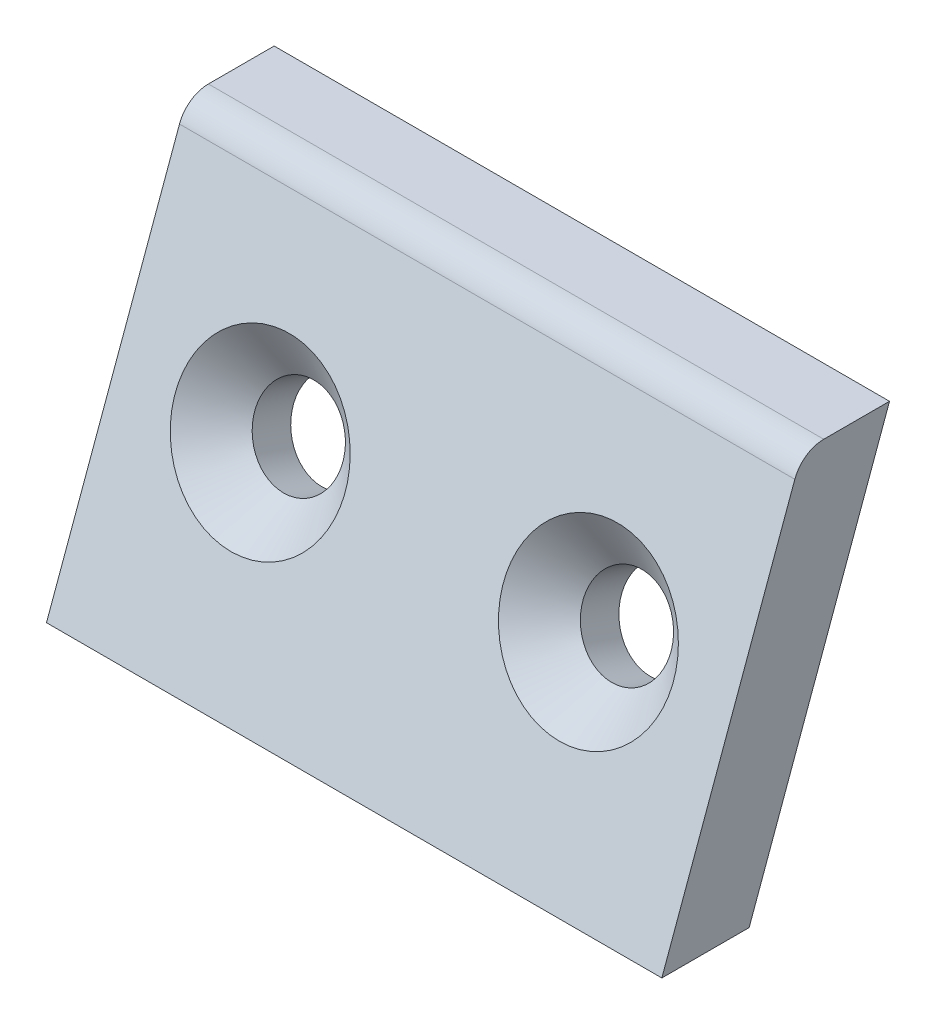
ISO-10303-21;
HEADER;
FILE_DESCRIPTION(('STEP AP214'),'2;1');
FILE_NAME('part.step','',(''),(''),'','','');
FILE_SCHEMA(('AUTOMOTIVE_DESIGN { 1 0 10303 214 1 1 1 1 }'));
ENDSEC;
DATA;
#1=APPLICATION_CONTEXT('core data for automotive mechanical design processes');
#2=APPLICATION_PROTOCOL_DEFINITION('international standard','automotive_design',2000,#1);
#3=PRODUCT_CONTEXT('',#1,'mechanical');
#4=PRODUCT('Part','Part','',(#3));
#5=PRODUCT_RELATED_PRODUCT_CATEGORY('part','',(#4));
#6=PRODUCT_DEFINITION_FORMATION('','',#4);
#7=PRODUCT_DEFINITION_CONTEXT('part definition',#1,'design');
#8=PRODUCT_DEFINITION('design','',#6,#7);
#9=PRODUCT_DEFINITION_SHAPE('','',#8);
#10=(LENGTH_UNIT() NAMED_UNIT(*) SI_UNIT(.MILLI.,.METRE.));
#11=(NAMED_UNIT(*) PLANE_ANGLE_UNIT() SI_UNIT($,.RADIAN.));
#12=(NAMED_UNIT(*) SI_UNIT($,.STERADIAN.) SOLID_ANGLE_UNIT());
#13=UNCERTAINTY_MEASURE_WITH_UNIT(LENGTH_MEASURE(1.E-05),#10,'distance_accuracy_value','');
#14=(GEOMETRIC_REPRESENTATION_CONTEXT(3) GLOBAL_UNCERTAINTY_ASSIGNED_CONTEXT((#13)) GLOBAL_UNIT_ASSIGNED_CONTEXT((#10,
#11,#12)) REPRESENTATION_CONTEXT('',''));
#15=CARTESIAN_POINT('',(0.,0.,0.));
#16=DIRECTION('',(0.,0.,1.));
#17=DIRECTION('',(1.,0.,0.));
#18=AXIS2_PLACEMENT_3D('',#15,#16,#17);
#19=CARTESIAN_POINT('',(30.,0.,-4.25671108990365));
#20=DIRECTION('',(0.,1.,0.));
#21=DIRECTION('',(0.,0.,1.));
#22=AXIS2_PLACEMENT_3D('',#19,#20,#21);
#23=PLANE('',#22);
#24=DIRECTION('',(0.,0.,-1.));
#25=VECTOR('',#24,1.);
#26=CARTESIAN_POINT('',(0.,0.,-4.25671108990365));
#27=LINE('',#26,#25);
#28=CARTESIAN_POINT('',(0.,0.,0.));
#29=VERTEX_POINT('',#28);
#30=CARTESIAN_POINT('',(0.,0.,-4.25671108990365));
#31=VERTEX_POINT('',#30);
#32=EDGE_CURVE('E111',#29,#31,#27,.T.);
#33=ORIENTED_EDGE('',*,*,#32,.T.);
#34=DIRECTION('',(-1.,0.,0.));
#35=VECTOR('',#34,1.);
#36=CARTESIAN_POINT('',(30.,0.,-4.25671108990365));
#37=LINE('',#36,#35);
#38=CARTESIAN_POINT('',(30.,0.,-4.25671108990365));
#39=VERTEX_POINT('',#38);
#40=EDGE_CURVE('E11',#39,#31,#37,.T.);
#41=ORIENTED_EDGE('',*,*,#40,.F.);
#42=DIRECTION('',(0.,0.,-1.));
#43=VECTOR('',#42,1.);
#44=CARTESIAN_POINT('',(30.,0.,-4.25671108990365));
#45=LINE('',#44,#43);
#46=CARTESIAN_POINT('',(30.,0.,0.));
#47=VERTEX_POINT('',#46);
#48=EDGE_CURVE('E120',#47,#39,#45,.T.);
#49=ORIENTED_EDGE('',*,*,#48,.F.);
#50=DIRECTION('',(-1.,0.,0.));
#51=VECTOR('',#50,1.);
#52=CARTESIAN_POINT('',(30.,0.,0.));
#53=LINE('',#52,#51);
#54=EDGE_CURVE('E107',#47,#29,#53,.T.);
#55=ORIENTED_EDGE('',*,*,#54,.T.);
#56=EDGE_LOOP('',(#33,#41,#49,#55));
#57=FACE_BOUND('',#56,.T.);
#58=ADVANCED_FACE('F35',(#57),#23,.F.);
#59=CARTESIAN_POINT('',(30.,18.8,-11.0993514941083));
#60=DIRECTION('',(0.,0.342020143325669,0.939692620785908));
#61=DIRECTION('',(0.,-0.939692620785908,0.342020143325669));
#62=AXIS2_PLACEMENT_3D('',#59,#60,#61);
#63=PLANE('',#62);
#64=CARTESIAN_POINT('',(7.,8.0288456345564,-7.17897191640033));
#65=DIRECTION('',(0.,0.342020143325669,0.939692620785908));
#66=DIRECTION('',(0.,-0.939692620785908,0.342020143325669));
#67=AXIS2_PLACEMENT_3D('',#64,#65,#66);
#68=CIRCLE('',#67,2.15);
#69=CARTESIAN_POINT('',(7.,6.0085064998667,-6.44362860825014));
#70=VERTEX_POINT('',#69);
#71=EDGE_CURVE('E38',#70,#70,#68,.T.);
#72=ORIENTED_EDGE('',*,*,#71,.T.);
#73=EDGE_LOOP('',(#72));
#74=FACE_BOUND('',#73,.T.);
#75=CARTESIAN_POINT('',(23.,8.0288456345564,-7.17897191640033));
#76=DIRECTION('',(0.,0.342020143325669,0.939692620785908));
#77=DIRECTION('',(0.,-0.939692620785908,0.342020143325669));
#78=AXIS2_PLACEMENT_3D('',#75,#76,#77);
#79=CIRCLE('',#78,2.15);
#80=CARTESIAN_POINT('',(23.,6.0085064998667,-6.44362860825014));
#81=VERTEX_POINT('',#80);
#82=EDGE_CURVE('E115',#81,#81,#79,.T.);
#83=ORIENTED_EDGE('',*,*,#82,.T.);
#84=EDGE_LOOP('',(#83));
#85=FACE_BOUND('',#84,.T.);
#86=DIRECTION('',(0.,0.939692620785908,-0.342020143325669));
#87=VECTOR('',#86,1.);
#88=CARTESIAN_POINT('',(0.,18.8,-11.0993514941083));
#89=LINE('',#88,#87);
#90=CARTESIAN_POINT('',(0.,18.8,-11.0993514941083));
#91=VERTEX_POINT('',#90);
#92=EDGE_CURVE('E114',#31,#91,#89,.T.);
#93=ORIENTED_EDGE('',*,*,#92,.T.);
#94=DIRECTION('',(-1.,0.,0.));
#95=VECTOR('',#94,1.);
#96=CARTESIAN_POINT('',(30.,18.8,-11.0993514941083));
#97=LINE('',#96,#95);
#98=CARTESIAN_POINT('',(30.,18.8,-11.0993514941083));
#99=VERTEX_POINT('',#98);
#100=EDGE_CURVE('E44',#99,#91,#97,.T.);
#101=ORIENTED_EDGE('',*,*,#100,.F.);
#102=DIRECTION('',(0.,0.939692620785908,-0.342020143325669));
#103=VECTOR('',#102,1.);
#104=CARTESIAN_POINT('',(30.,18.8,-11.0993514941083));
#105=LINE('',#104,#103);
#106=EDGE_CURVE('E87',#39,#99,#105,.T.);
#107=ORIENTED_EDGE('',*,*,#106,.F.);
#108=ORIENTED_EDGE('',*,*,#40,.T.);
#109=EDGE_LOOP('',(#93,#101,#107,#108));
#110=FACE_BOUND('',#109,.T.);
#111=ADVANCED_FACE('F140',(#74,#85,#110),#63,.F.);
#112=CARTESIAN_POINT('',(30.,18.8,-7.89295171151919));
#113=DIRECTION('',(0.,-1.,0.));
#114=DIRECTION('',(0.,0.,-1.));
#115=AXIS2_PLACEMENT_3D('',#112,#113,#114);
#116=PLANE('',#115);
#117=DIRECTION('',(0.,0.,1.));
#118=VECTOR('',#117,1.);
#119=CARTESIAN_POINT('',(0.,18.8,-7.89295171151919));
#120=LINE('',#119,#118);
#121=CARTESIAN_POINT('',(0.,18.8,-7.89295171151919));
#122=VERTEX_POINT('',#121);
#123=EDGE_CURVE('E102',#91,#122,#120,.T.);
#124=ORIENTED_EDGE('',*,*,#123,.T.);
#125=DIRECTION('',(-1.,0.,0.));
#126=VECTOR('',#125,1.);
#127=CARTESIAN_POINT('',(30.,18.8,-7.89295171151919));
#128=LINE('',#127,#126);
#129=CARTESIAN_POINT('',(30.,18.8,-7.89295171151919));
#130=VERTEX_POINT('',#129);
#131=EDGE_CURVE('E99',#130,#122,#128,.T.);
#132=ORIENTED_EDGE('',*,*,#131,.F.);
#133=DIRECTION('',(0.,0.,1.));
#134=VECTOR('',#133,1.);
#135=CARTESIAN_POINT('',(30.,18.8,-7.89295171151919));
#136=LINE('',#135,#134);
#137=EDGE_CURVE('E91',#99,#130,#136,.T.);
#138=ORIENTED_EDGE('',*,*,#137,.F.);
#139=ORIENTED_EDGE('',*,*,#100,.T.);
#140=EDGE_LOOP('',(#124,#132,#138,#139));
#141=FACE_BOUND('',#140,.T.);
#142=ADVANCED_FACE('F100',(#141),#116,.F.);
#143=CARTESIAN_POINT('',(30.,17.3,-7.89295171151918));
#144=DIRECTION('',(-1.,0.,0.));
#145=DIRECTION('',(0.,0.,1.));
#146=AXIS2_PLACEMENT_3D('',#143,#144,#145);
#147=CYLINDRICAL_SURFACE('',#146,1.5);
#148=CARTESIAN_POINT('',(0.,17.3,-7.89295171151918));
#149=DIRECTION('',(1.,0.,0.));
#150=DIRECTION('',(0.,0.,1.));
#151=AXIS2_PLACEMENT_3D('',#148,#149,#150);
#152=CIRCLE('',#151,1.5);
#153=CARTESIAN_POINT('',(0.,17.8130302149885,-6.48341278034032));
#154=VERTEX_POINT('',#153);
#155=EDGE_CURVE('E73',#122,#154,#152,.T.);
#156=ORIENTED_EDGE('',*,*,#155,.T.);
#157=DIRECTION('',(-1.,0.,0.));
#158=VECTOR('',#157,1.);
#159=CARTESIAN_POINT('',(30.,17.8130302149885,-6.48341278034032));
#160=LINE('',#159,#158);
#161=CARTESIAN_POINT('',(30.,17.8130302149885,-6.48341278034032));
#162=VERTEX_POINT('',#161);
#163=EDGE_CURVE('E103',#162,#154,#160,.T.);
#164=ORIENTED_EDGE('',*,*,#163,.F.);
#165=CARTESIAN_POINT('',(30.,17.3,-7.89295171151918));
#166=DIRECTION('',(1.,0.,0.));
#167=DIRECTION('',(0.,0.,1.));
#168=AXIS2_PLACEMENT_3D('',#165,#166,#167);
#169=CIRCLE('',#168,1.5);
#170=EDGE_CURVE('E95',#130,#162,#169,.T.);
#171=ORIENTED_EDGE('',*,*,#170,.F.);
#172=ORIENTED_EDGE('',*,*,#131,.T.);
#173=EDGE_LOOP('',(#156,#164,#171,#172));
#174=FACE_BOUND('',#173,.T.);
#175=ADVANCED_FACE('F105',(#174),#147,.T.);
#176=CARTESIAN_POINT('',(30.,0.,0.));
#177=DIRECTION('',(0.,-0.342020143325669,-0.939692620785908));
#178=DIRECTION('',(0.,0.939692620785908,-0.34202014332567));
#179=AXIS2_PLACEMENT_3D('',#176,#177,#178);
#180=PLANE('',#179);
#181=CARTESIAN_POINT('',(7.,9.39692620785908,-3.4202014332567));
#182=DIRECTION('',(0.,0.34202014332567,0.939692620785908));
#183=DIRECTION('',(0.,-0.939692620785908,0.34202014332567));
#184=AXIS2_PLACEMENT_3D('',#181,#182,#183);
#185=CIRCLE('',#184,4.15);
#186=CARTESIAN_POINT('',(7.,5.49720183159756,-2.00081783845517));
#187=VERTEX_POINT('',#186);
#188=EDGE_CURVE('E174',#187,#187,#185,.T.);
#189=ORIENTED_EDGE('',*,*,#188,.F.);
#190=EDGE_LOOP('',(#189));
#191=FACE_BOUND('',#190,.T.);
#192=CARTESIAN_POINT('',(23.,9.39692620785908,-3.4202014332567));
#193=DIRECTION('',(0.,0.34202014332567,0.939692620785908));
#194=DIRECTION('',(0.,-0.939692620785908,0.34202014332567));
#195=AXIS2_PLACEMENT_3D('',#192,#193,#194);
#196=CIRCLE('',#195,4.15);
#197=CARTESIAN_POINT('',(23.,5.49720183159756,-2.00081783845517));
#198=VERTEX_POINT('',#197);
#199=EDGE_CURVE('E128',#198,#198,#196,.T.);
#200=ORIENTED_EDGE('',*,*,#199,.F.);
#201=EDGE_LOOP('',(#200));
#202=FACE_BOUND('',#201,.T.);
#203=DIRECTION('',(0.,-0.939692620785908,0.342020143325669));
#204=VECTOR('',#203,1.);
#205=CARTESIAN_POINT('',(0.,0.,0.));
#206=LINE('',#205,#204);
#207=EDGE_CURVE('E79',#154,#29,#206,.T.);
#208=ORIENTED_EDGE('',*,*,#207,.T.);
#209=ORIENTED_EDGE('',*,*,#54,.F.);
#210=DIRECTION('',(0.,-0.939692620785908,0.342020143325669));
#211=VECTOR('',#210,1.);
#212=CARTESIAN_POINT('',(30.,0.,0.));
#213=LINE('',#212,#211);
#214=EDGE_CURVE('E53',#162,#47,#213,.T.);
#215=ORIENTED_EDGE('',*,*,#214,.F.);
#216=ORIENTED_EDGE('',*,*,#163,.T.);
#217=EDGE_LOOP('',(#208,#209,#215,#216));
#218=FACE_BOUND('',#217,.T.);
#219=ADVANCED_FACE('F152',(#191,#202,#218),#180,.F.);
#220=CARTESIAN_POINT('',(30.,17.3,-7.89295171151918));
#221=DIRECTION('',(-1.,0.,0.));
#222=DIRECTION('',(0.,0.,1.));
#223=AXIS2_PLACEMENT_3D('',#220,#221,#222);
#224=PLANE('',#223);
#225=ORIENTED_EDGE('',*,*,#48,.T.);
#226=ORIENTED_EDGE('',*,*,#106,.T.);
#227=ORIENTED_EDGE('',*,*,#137,.T.);
#228=ORIENTED_EDGE('',*,*,#170,.T.);
#229=ORIENTED_EDGE('',*,*,#214,.T.);
#230=EDGE_LOOP('',(#225,#226,#227,#228,#229));
#231=FACE_BOUND('',#230,.T.);
#232=ADVANCED_FACE('F93',(#231),#224,.F.);
#233=CARTESIAN_POINT('',(0.,17.3,-7.89295171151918));
#234=DIRECTION('',(-1.,0.,0.));
#235=DIRECTION('',(0.,0.,1.));
#236=AXIS2_PLACEMENT_3D('',#233,#234,#235);
#237=PLANE('',#236);
#238=ORIENTED_EDGE('',*,*,#32,.F.);
#239=ORIENTED_EDGE('',*,*,#207,.F.);
#240=ORIENTED_EDGE('',*,*,#155,.F.);
#241=ORIENTED_EDGE('',*,*,#123,.F.);
#242=ORIENTED_EDGE('',*,*,#92,.F.);
#243=EDGE_LOOP('',(#238,#239,#240,#241,#242));
#244=FACE_BOUND('',#243,.T.);
#245=ADVANCED_FACE('F142',(#244),#237,.T.);
#246=CARTESIAN_POINT('',(23.,9.39692620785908,-3.4202014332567));
#247=DIRECTION('',(0.,0.34202014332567,0.939692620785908));
#248=DIRECTION('',(0.,-0.939692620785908,0.34202014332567));
#249=AXIS2_PLACEMENT_3D('',#246,#247,#248);
#250=CYLINDRICAL_SURFACE('',#249,2.15);
#251=CARTESIAN_POINT('',(23.,8.71288592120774,-5.29958667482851));
#252=DIRECTION('',(0.,0.34202014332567,0.939692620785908));
#253=DIRECTION('',(0.,-0.939692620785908,0.34202014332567));
#254=AXIS2_PLACEMENT_3D('',#251,#252,#253);
#255=CIRCLE('',#254,2.15);
#256=CARTESIAN_POINT('',(23.,6.69254678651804,-4.56424336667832));
#257=VERTEX_POINT('',#256);
#258=EDGE_CURVE('E124',#257,#257,#255,.T.);
#259=ORIENTED_EDGE('',*,*,#258,.T.);
#260=EDGE_LOOP('',(#259));
#261=FACE_BOUND('',#260,.T.);
#262=ORIENTED_EDGE('',*,*,#82,.F.);
#263=EDGE_LOOP('',(#262));
#264=FACE_BOUND('',#263,.T.);
#265=ADVANCED_FACE('F144',(#261,#264),#250,.F.);
#266=CARTESIAN_POINT('',(23.,9.39692620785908,-3.4202014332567));
#267=DIRECTION('',(0.,0.34202014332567,0.939692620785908));
#268=DIRECTION('',(0.,-0.939692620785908,0.34202014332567));
#269=AXIS2_PLACEMENT_3D('',#266,#267,#268);
#270=CONICAL_SURFACE('',#269,4.15,0.785398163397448);
#271=ORIENTED_EDGE('',*,*,#258,.F.);
#272=EDGE_LOOP('',(#271));
#273=FACE_BOUND('',#272,.T.);
#274=ORIENTED_EDGE('',*,*,#199,.T.);
#275=EDGE_LOOP('',(#274));
#276=FACE_BOUND('',#275,.T.);
#277=ADVANCED_FACE('F150',(#273,#276),#270,.F.);
#278=CARTESIAN_POINT('',(7.,9.39692620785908,-3.4202014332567));
#279=DIRECTION('',(0.,0.34202014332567,0.939692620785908));
#280=DIRECTION('',(0.,-0.939692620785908,0.34202014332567));
#281=AXIS2_PLACEMENT_3D('',#278,#279,#280);
#282=CYLINDRICAL_SURFACE('',#281,2.15);
#283=CARTESIAN_POINT('',(7.,8.71288592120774,-5.29958667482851));
#284=DIRECTION('',(0.,0.34202014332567,0.939692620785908));
#285=DIRECTION('',(0.,-0.939692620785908,0.34202014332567));
#286=AXIS2_PLACEMENT_3D('',#283,#284,#285);
#287=CIRCLE('',#286,2.15);
#288=CARTESIAN_POINT('',(7.,6.69254678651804,-4.56424336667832));
#289=VERTEX_POINT('',#288);
#290=EDGE_CURVE('E195',#289,#289,#287,.T.);
#291=ORIENTED_EDGE('',*,*,#290,.T.);
#292=EDGE_LOOP('',(#291));
#293=FACE_BOUND('',#292,.T.);
#294=ORIENTED_EDGE('',*,*,#71,.F.);
#295=EDGE_LOOP('',(#294));
#296=FACE_BOUND('',#295,.T.);
#297=ADVANCED_FACE('F178',(#293,#296),#282,.F.);
#298=CARTESIAN_POINT('',(7.,9.39692620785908,-3.4202014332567));
#299=DIRECTION('',(0.,0.34202014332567,0.939692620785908));
#300=DIRECTION('',(0.,-0.939692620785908,0.34202014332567));
#301=AXIS2_PLACEMENT_3D('',#298,#299,#300);
#302=CONICAL_SURFACE('',#301,4.15,0.785398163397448);
#303=ORIENTED_EDGE('',*,*,#290,.F.);
#304=EDGE_LOOP('',(#303));
#305=FACE_BOUND('',#304,.T.);
#306=ORIENTED_EDGE('',*,*,#188,.T.);
#307=EDGE_LOOP('',(#306));
#308=FACE_BOUND('',#307,.T.);
#309=ADVANCED_FACE('F184',(#305,#308),#302,.F.);
#310=CLOSED_SHELL('',(#58,#111,#142,#175,#219,#232,#245,#265,#277,#297,#309));
#311=MANIFOLD_SOLID_BREP('B2',#310);
#312=ADVANCED_BREP_SHAPE_REPRESENTATION('',(#18,#311),#14);
#313=SHAPE_DEFINITION_REPRESENTATION(#9,#312);
ENDSEC;
END-ISO-10303-21;
